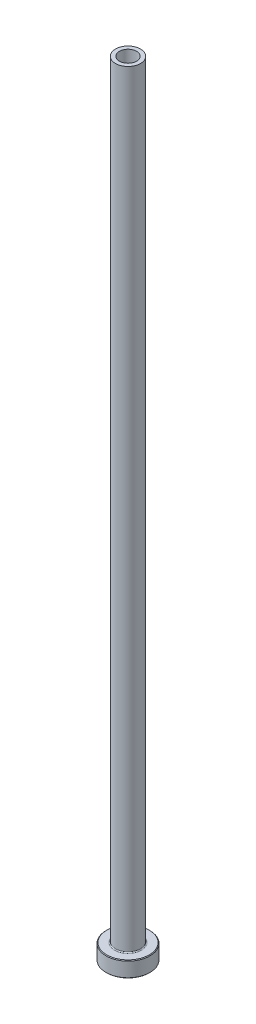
from build123d import *

# Parameters (mm, degrees)
FILLET1_R     = 0.3
CHAMFER1_SIZE = 0.2
CHAMFER3_SIZE = 0.5


with BuildPart() as part:
    # Sketch1 → Revolve1 (revolve)
    with BuildSketch(Plane.XY, mode=Mode.PRIVATE) as revolve1_sk:
        Polygon((-2.75, 250), (-4, 250), (-4, 5), (-7, 5), (-7, 0), (-3, 0), (-3, 193), (-2.75, 205), align=None)
    revolve(revolve1_sk.sketch.rotate(Axis((0, 92.187680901, 0), (0, -1, 0)), 270), axis=Axis((0, 92.187680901, 0), (0, -1, 0)))

    # Fillet1
    fillet1_edges = [part.edges().sort_by_distance(p)[0] for p in [
        (0, 5, -4),
    ]]
    fillet(fillet1_edges, radius=FILLET1_R)

    # Chamfer1
    chamfer1_edges = [part.edges().sort_by_distance(p)[0] for p in [
        (0, 0, -7),
        (0, 5, -7),
    ]]
    chamfer(chamfer1_edges, length=CHAMFER1_SIZE)

    # Chamfer3
    chamfer3_edges = [part.edges().sort_by_distance(p)[0] for p in [
        (0, 0, -3),
    ]]
    chamfer(chamfer3_edges, length=CHAMFER3_SIZE)


solid = part.part
